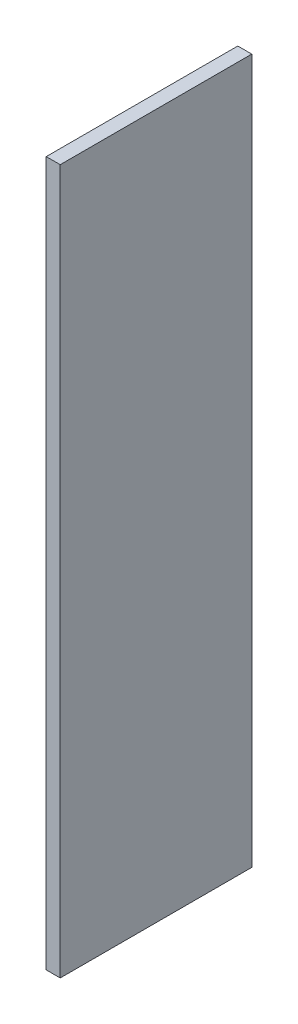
from build123d import *

# Parameters (mm, degrees)
SKETCH1_W           = 3
SKETCH1_H           = 151.104606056
BOSS_EXTRUDE1_DEPTH = 41.094388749


with BuildPart() as part:
    # Sketch1 → Boss-Extrude1 (new body)
    with BuildSketch(Plane.XY):
        with Locations((-2.25, 18.052303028)):
            Rectangle(SKETCH1_W, SKETCH1_H)
    extrude(amount=BOSS_EXTRUDE1_DEPTH)


solid = part.part
